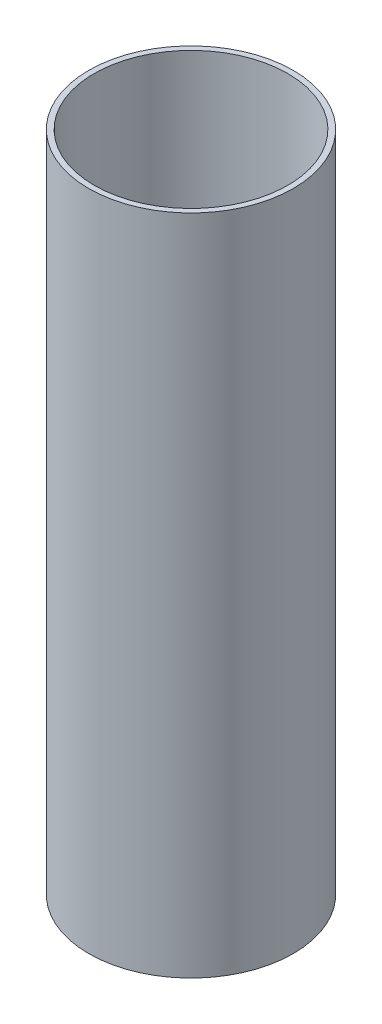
ISO-10303-21;
HEADER;
FILE_DESCRIPTION(('STEP AP214'),'2;1');
FILE_NAME('part.step','',(''),(''),'','','');
FILE_SCHEMA(('AUTOMOTIVE_DESIGN { 1 0 10303 214 1 1 1 1 }'));
ENDSEC;
DATA;
#1=APPLICATION_CONTEXT('core data for automotive mechanical design processes');
#2=APPLICATION_PROTOCOL_DEFINITION('international standard','automotive_design',2000,#1);
#3=PRODUCT_CONTEXT('',#1,'mechanical');
#4=PRODUCT('Part','Part','',(#3));
#5=PRODUCT_RELATED_PRODUCT_CATEGORY('part','',(#4));
#6=PRODUCT_DEFINITION_FORMATION('','',#4);
#7=PRODUCT_DEFINITION_CONTEXT('part definition',#1,'design');
#8=PRODUCT_DEFINITION('design','',#6,#7);
#9=PRODUCT_DEFINITION_SHAPE('','',#8);
#10=(LENGTH_UNIT() NAMED_UNIT(*) SI_UNIT(.MILLI.,.METRE.));
#11=(NAMED_UNIT(*) PLANE_ANGLE_UNIT() SI_UNIT($,.RADIAN.));
#12=(NAMED_UNIT(*) SI_UNIT($,.STERADIAN.) SOLID_ANGLE_UNIT());
#13=UNCERTAINTY_MEASURE_WITH_UNIT(LENGTH_MEASURE(1.E-05),#10,'distance_accuracy_value','');
#14=(GEOMETRIC_REPRESENTATION_CONTEXT(3) GLOBAL_UNCERTAINTY_ASSIGNED_CONTEXT((#13)) GLOBAL_UNIT_ASSIGNED_CONTEXT((#10,
#11,#12)) REPRESENTATION_CONTEXT('',''));
#15=CARTESIAN_POINT('',(0.,0.,0.));
#16=DIRECTION('',(0.,0.,1.));
#17=DIRECTION('',(1.,0.,0.));
#18=AXIS2_PLACEMENT_3D('',#15,#16,#17);
#19=CARTESIAN_POINT('',(0.,184.15,0.));
#20=DIRECTION('',(0.,1.,0.));
#21=DIRECTION('',(0.,0.,1.));
#22=AXIS2_PLACEMENT_3D('',#19,#20,#21);
#23=PLANE('',#22);
#24=CARTESIAN_POINT('',(0.,184.15,0.));
#25=DIRECTION('',(0.,1.,0.));
#26=DIRECTION('',(0.,0.,1.));
#27=AXIS2_PLACEMENT_3D('',#24,#25,#26);
#28=CIRCLE('',#27,28.4353);
#29=CARTESIAN_POINT('',(0.,184.15,28.4353));
#30=VERTEX_POINT('',#29);
#31=EDGE_CURVE('E10',#30,#30,#28,.T.);
#32=ORIENTED_EDGE('',*,*,#31,.T.);
#33=EDGE_LOOP('',(#32));
#34=FACE_BOUND('',#33,.T.);
#35=CARTESIAN_POINT('',(0.,184.15,0.));
#36=DIRECTION('',(0.,1.,0.));
#37=DIRECTION('',(0.,0.,1.));
#38=AXIS2_PLACEMENT_3D('',#35,#36,#37);
#39=CIRCLE('',#38,26.9113);
#40=CARTESIAN_POINT('',(0.,184.15,26.9113));
#41=VERTEX_POINT('',#40);
#42=EDGE_CURVE('E54',#41,#41,#39,.T.);
#43=ORIENTED_EDGE('',*,*,#42,.F.);
#44=EDGE_LOOP('',(#43));
#45=FACE_BOUND('',#44,.T.);
#46=ADVANCED_FACE('F40',(#34,#45),#23,.T.);
#47=CARTESIAN_POINT('',(0.,0.,0.));
#48=DIRECTION('',(0.,1.,0.));
#49=DIRECTION('',(0.,0.,1.));
#50=AXIS2_PLACEMENT_3D('',#47,#48,#49);
#51=PLANE('',#50);
#52=CARTESIAN_POINT('',(0.,0.,0.));
#53=DIRECTION('',(0.,1.,0.));
#54=DIRECTION('',(0.,0.,1.));
#55=AXIS2_PLACEMENT_3D('',#52,#53,#54);
#56=CIRCLE('',#55,28.4353);
#57=CARTESIAN_POINT('',(0.,0.,28.4353));
#58=VERTEX_POINT('',#57);
#59=EDGE_CURVE('E44',#58,#58,#56,.T.);
#60=ORIENTED_EDGE('',*,*,#59,.F.);
#61=EDGE_LOOP('',(#60));
#62=FACE_BOUND('',#61,.T.);
#63=CARTESIAN_POINT('',(0.,0.,0.));
#64=DIRECTION('',(0.,1.,0.));
#65=DIRECTION('',(0.,0.,1.));
#66=AXIS2_PLACEMENT_3D('',#63,#64,#65);
#67=CIRCLE('',#66,26.9113);
#68=CARTESIAN_POINT('',(0.,0.,26.9113));
#69=VERTEX_POINT('',#68);
#70=EDGE_CURVE('E56',#69,#69,#67,.T.);
#71=ORIENTED_EDGE('',*,*,#70,.T.);
#72=EDGE_LOOP('',(#71));
#73=FACE_BOUND('',#72,.T.);
#74=ADVANCED_FACE('F69',(#62,#73),#51,.F.);
#75=CARTESIAN_POINT('',(0.,184.15,0.));
#76=DIRECTION('',(0.,-1.,0.));
#77=DIRECTION('',(0.,0.,-1.));
#78=AXIS2_PLACEMENT_3D('',#75,#76,#77);
#79=CYLINDRICAL_SURFACE('',#78,28.4353);
#80=ORIENTED_EDGE('',*,*,#31,.F.);
#81=EDGE_LOOP('',(#80));
#82=FACE_BOUND('',#81,.T.);
#83=ORIENTED_EDGE('',*,*,#59,.T.);
#84=EDGE_LOOP('',(#83));
#85=FACE_BOUND('',#84,.T.);
#86=ADVANCED_FACE('F42',(#82,#85),#79,.T.);
#87=CARTESIAN_POINT('',(0.,184.15,0.));
#88=DIRECTION('',(0.,-1.,0.));
#89=DIRECTION('',(0.,0.,-1.));
#90=AXIS2_PLACEMENT_3D('',#87,#88,#89);
#91=CYLINDRICAL_SURFACE('',#90,26.9113);
#92=ORIENTED_EDGE('',*,*,#42,.T.);
#93=EDGE_LOOP('',(#92));
#94=FACE_BOUND('',#93,.T.);
#95=ORIENTED_EDGE('',*,*,#70,.F.);
#96=EDGE_LOOP('',(#95));
#97=FACE_BOUND('',#96,.T.);
#98=ADVANCED_FACE('F65',(#94,#97),#91,.F.);
#99=CLOSED_SHELL('',(#46,#74,#86,#98));
#100=MANIFOLD_SOLID_BREP('B2',#99);
#101=ADVANCED_BREP_SHAPE_REPRESENTATION('',(#18,#100),#14);
#102=SHAPE_DEFINITION_REPRESENTATION(#9,#101);
ENDSEC;
END-ISO-10303-21;
